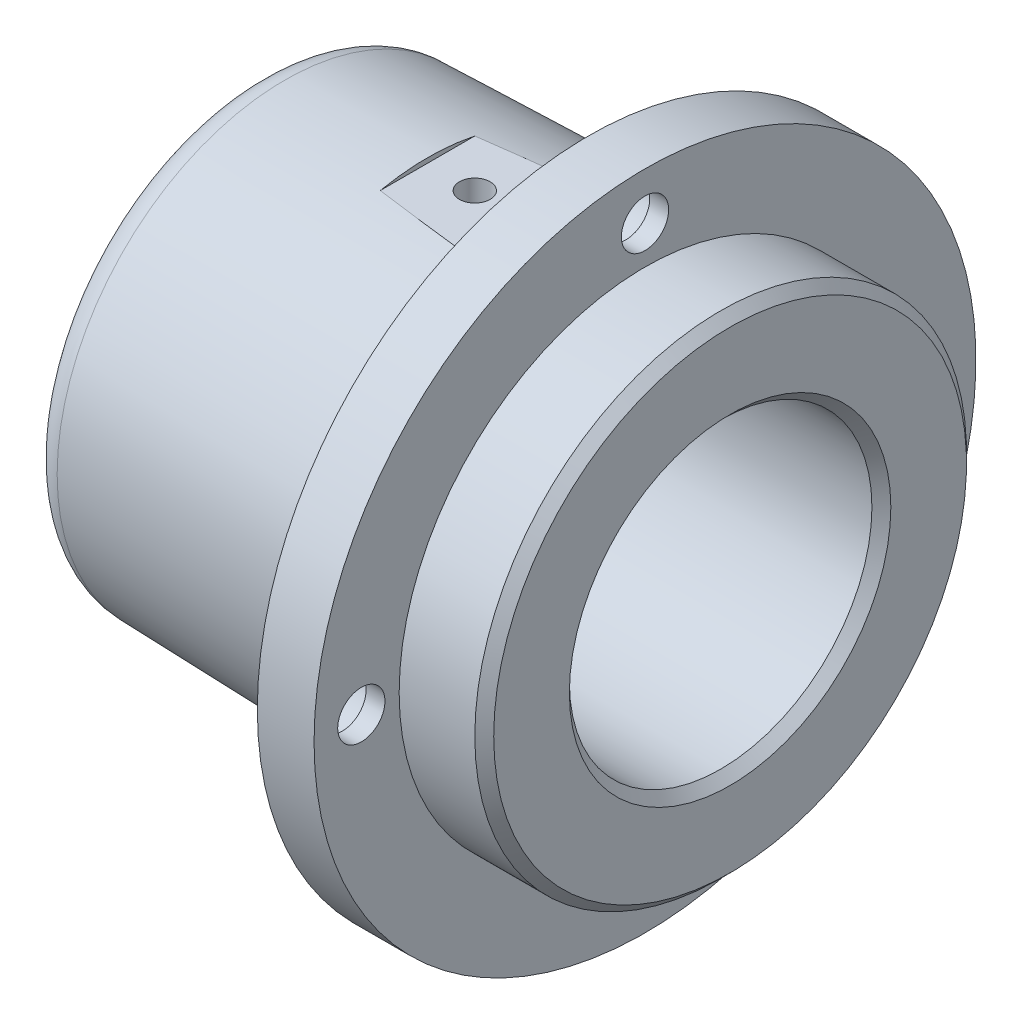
from build123d import *

# Parameters (mm, degrees)
CONG_1_R                     = 3
CONG_3_R                     = 1
CHANFREIN1_SIZE              = 1
ESQUISSE8_R                  = 4
ENL_V_MAT_EXTRU_1_DEPTH      = 4
ESQUISSE9_R                  = 2.5
ENL_V_MAT_EXTRU_2_DEPTH      = 64.015871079
R_P_TITION_CIRCULAIRE1_COUNT = 4
ESQUISSE10_W                 = 10
ESQUISSE10_H                 = 3.990671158
ENL_V_MAT_EXTRU_3_DEPTH      = 25
ENL_V_MAT_EXTRU_4_REACH      = 86.888
ENL_V_MAT_EXTRU_4_END_RADIUS = 16
ESQUISSE11_R                 = 1.622


with BuildPart() as part:
    # Esquisse1 → Base-R_volution (revolve)
    with BuildSketch(Plane.XY, mode=Mode.PRIVATE) as base_r_volution_sk:
        Polygon((0, 16), (0, 24), (35, 25), (35, 35), (41, 35), (41, 26), (50, 26), (50, 16), align=None)
    revolve(base_r_volution_sk.sketch.rotate(Axis((-12.308370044, 0, 0), (1, 0, 0)), 90), axis=Axis((-12.308370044, 0, 0), (1, 0, 0)))

    # Cong_1
    cong_1_edges = [part.edges().sort_by_distance(p)[0] for p in [
        (0, 0, -24),
    ]]
    fillet(cong_1_edges, radius=CONG_1_R)

    # Cong_3
    cong_3_edges = [part.edges().sort_by_distance(p)[0] for p in [
        (35, 0, -25),
    ]]
    fillet(cong_3_edges, radius=CONG_3_R)

    # Chanfrein1
    chanfrein1_edges = [part.edges().sort_by_distance(p)[0] for p in [
        (0, 0, -16),
        (50, 0, -16),
        (50, 0, -26),
    ]]
    chamfer(chanfrein1_edges, length=CHANFREIN1_SIZE)

    # Esquisse8 → Enl_v. mat.-Extru.1 (cut)
    with BuildSketch(Plane.ZY.offset(-35)):
        with Locations((0, 30)):
            Circle(ESQUISSE8_R)
    enl_v_mat_extru_1 = extrude(amount=-ENL_V_MAT_EXTRU_1_DEPTH, mode=Mode.SUBTRACT)

    # Esquisse9 → Enl_v. mat.-Extru.2 (cut, through all)
    with BuildSketch(Plane.ZY.offset(-39)):
        with Locations((0, 30)):
            Circle(ESQUISSE9_R)
    enl_v_mat_extru_2 = extrude(amount=-ENL_V_MAT_EXTRU_2_DEPTH, mode=Mode.SUBTRACT)

    # R_p_tition circulaire1: Enl_v. mat.-Extru.1, Enl_v. mat.-Extru.2 ×4 about axis
    r_p_tition_circulaire1_axis = Axis((0, 0, 0), (1, 0, 0))
    add([enl_v_mat_extru_1.rotate(r_p_tition_circulaire1_axis, i * 360 / R_P_TITION_CIRCULAIRE1_COUNT) for i in range(1, R_P_TITION_CIRCULAIRE1_COUNT)], mode=Mode.SUBTRACT)
    add([enl_v_mat_extru_2.rotate(r_p_tition_circulaire1_axis, i * 360 / R_P_TITION_CIRCULAIRE1_COUNT) for i in range(1, R_P_TITION_CIRCULAIRE1_COUNT)], mode=Mode.SUBTRACT)

    # Esquisse10 → Enl_v. mat.-Extru.3 (cut, symmetric)
    with BuildSketch(Plane.XY):
        with Locations((23, 25.995335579)):
            Rectangle(ESQUISSE10_W, ESQUISSE10_H)
    extrude(amount=ENL_V_MAT_EXTRU_3_DEPTH, both=True, mode=Mode.SUBTRACT)

    # Enl_v. mat.-Extru.4: up to this cylinder (the profile starts outside it)
    enl_v_mat_extru_4_end = Plane(origin=(23, 0, 0), z_dir=(-1, 0, 0)) * Cylinder(ENL_V_MAT_EXTRU_4_END_RADIUS, 206.776, mode=Mode.PRIVATE)
    # Esquisse11 → Enl_v. mat.-Extru.4 (cut, up to the surface)
    with BuildSketch(Plane(origin=(0, 24, 0), x_dir=(-1, 0, 0), z_dir=(0, 1, 0)), mode=Mode.PRIVATE) as enl_v_mat_extru_4_sk1:
        with Locations(Location((-23, 0, 0), (0, 0, 90))):
            Circle(ESQUISSE11_R)
    enl_v_mat_extru_4_tool1 = extrude(enl_v_mat_extru_4_sk1.sketch, amount=-ENL_V_MAT_EXTRU_4_REACH, mode=Mode.PRIVATE) - enl_v_mat_extru_4_end
    add(enl_v_mat_extru_4_tool1.solids().sort_by_distance((23, 24, 0))[0], mode=Mode.SUBTRACT)


solid = part.part
